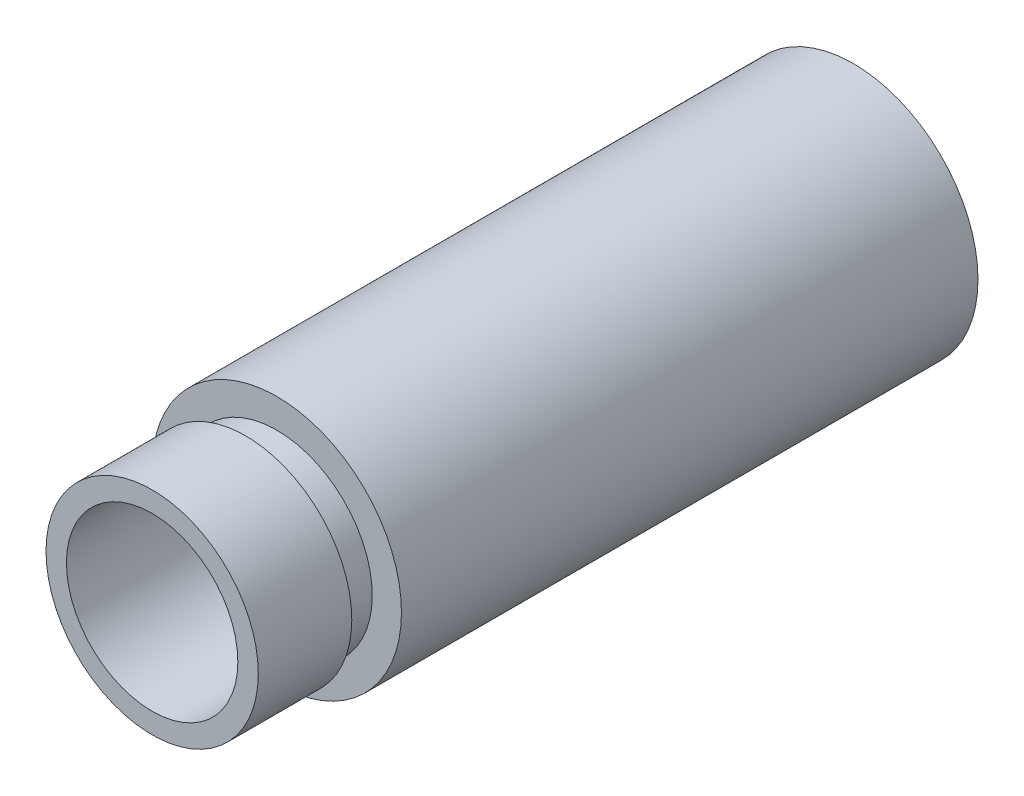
ISO-10303-21;
HEADER;
FILE_DESCRIPTION(('STEP AP214'),'2;1');
FILE_NAME('part.step','',(''),(''),'','','');
FILE_SCHEMA(('AUTOMOTIVE_DESIGN { 1 0 10303 214 1 1 1 1 }'));
ENDSEC;
DATA;
#1=APPLICATION_CONTEXT('core data for automotive mechanical design processes');
#2=APPLICATION_PROTOCOL_DEFINITION('international standard','automotive_design',2000,#1);
#3=PRODUCT_CONTEXT('',#1,'mechanical');
#4=PRODUCT('Part','Part','',(#3));
#5=PRODUCT_RELATED_PRODUCT_CATEGORY('part','',(#4));
#6=PRODUCT_DEFINITION_FORMATION('','',#4);
#7=PRODUCT_DEFINITION_CONTEXT('part definition',#1,'design');
#8=PRODUCT_DEFINITION('design','',#6,#7);
#9=PRODUCT_DEFINITION_SHAPE('','',#8);
#10=(LENGTH_UNIT() NAMED_UNIT(*) SI_UNIT(.MILLI.,.METRE.));
#11=(NAMED_UNIT(*) PLANE_ANGLE_UNIT() SI_UNIT($,.RADIAN.));
#12=(NAMED_UNIT(*) SI_UNIT($,.STERADIAN.) SOLID_ANGLE_UNIT());
#13=UNCERTAINTY_MEASURE_WITH_UNIT(LENGTH_MEASURE(1.E-05),#10,'distance_accuracy_value','');
#14=(GEOMETRIC_REPRESENTATION_CONTEXT(3) GLOBAL_UNCERTAINTY_ASSIGNED_CONTEXT((#13)) GLOBAL_UNIT_ASSIGNED_CONTEXT((#10,
#11,#12)) REPRESENTATION_CONTEXT('',''));
#15=CARTESIAN_POINT('',(0.,0.,0.));
#16=DIRECTION('',(0.,0.,1.));
#17=DIRECTION('',(1.,0.,0.));
#18=AXIS2_PLACEMENT_3D('',#15,#16,#17);
#19=CARTESIAN_POINT('',(0.,0.,0.));
#20=DIRECTION('',(0.,0.,1.));
#21=DIRECTION('',(1.,0.,0.));
#22=AXIS2_PLACEMENT_3D('',#19,#20,#21);
#23=CYLINDRICAL_SURFACE('',#22,8.);
#24=CARTESIAN_POINT('',(0.,0.,0.));
#25=DIRECTION('',(0.,0.,1.));
#26=DIRECTION('',(1.,0.,0.));
#27=AXIS2_PLACEMENT_3D('',#24,#25,#26);
#28=CIRCLE('',#27,8.);
#29=CARTESIAN_POINT('',(8.,0.,0.));
#30=VERTEX_POINT('',#29);
#31=EDGE_CURVE('E45',#30,#30,#28,.T.);
#32=CARTESIAN_POINT('',(0.,0.,37.));
#33=DIRECTION('',(0.,0.,1.));
#34=DIRECTION('',(1.,0.,0.));
#35=AXIS2_PLACEMENT_3D('',#32,#33,#34);
#36=CIRCLE('',#35,8.);
#37=CARTESIAN_POINT('',(8.,0.,37.));
#38=VERTEX_POINT('',#37);
#39=EDGE_CURVE('E29',#38,#38,#36,.F.);
#40=CARTESIAN_POINT('',(8.,0.,0.));
#41=CARTESIAN_POINT('',(8.,0.,0.385416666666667));
#42=CARTESIAN_POINT('',(8.,0.,0.770833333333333));
#43=CARTESIAN_POINT('',(8.,0.,1.54166666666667));
#44=CARTESIAN_POINT('',(8.,0.,1.92708333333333));
#45=CARTESIAN_POINT('',(8.,0.,2.69791666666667));
#46=CARTESIAN_POINT('',(8.,0.,3.08333333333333));
#47=CARTESIAN_POINT('',(8.,0.,3.85416666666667));
#48=CARTESIAN_POINT('',(8.,0.,4.23958333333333));
#49=CARTESIAN_POINT('',(8.,0.,5.01041666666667));
#50=CARTESIAN_POINT('',(8.,0.,5.39583333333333));
#51=CARTESIAN_POINT('',(8.,0.,6.16666666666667));
#52=CARTESIAN_POINT('',(8.,0.,6.55208333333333));
#53=CARTESIAN_POINT('',(8.,0.,7.32291666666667));
#54=CARTESIAN_POINT('',(8.,0.,7.70833333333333));
#55=CARTESIAN_POINT('',(8.,0.,8.47916666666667));
#56=CARTESIAN_POINT('',(8.,0.,8.86458333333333));
#57=CARTESIAN_POINT('',(8.,0.,9.63541666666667));
#58=CARTESIAN_POINT('',(8.,0.,10.0208333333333));
#59=CARTESIAN_POINT('',(8.,0.,10.7916666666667));
#60=CARTESIAN_POINT('',(8.,0.,11.1770833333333));
#61=CARTESIAN_POINT('',(8.,0.,11.9479166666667));
#62=CARTESIAN_POINT('',(8.,0.,12.3333333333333));
#63=CARTESIAN_POINT('',(8.,0.,13.1041666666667));
#64=CARTESIAN_POINT('',(8.,0.,13.4895833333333));
#65=CARTESIAN_POINT('',(8.,0.,14.2604166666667));
#66=CARTESIAN_POINT('',(8.,0.,14.6458333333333));
#67=CARTESIAN_POINT('',(8.,0.,15.4166666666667));
#68=CARTESIAN_POINT('',(8.,0.,15.8020833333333));
#69=CARTESIAN_POINT('',(8.,0.,16.5729166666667));
#70=CARTESIAN_POINT('',(8.,0.,16.9583333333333));
#71=CARTESIAN_POINT('',(8.,0.,17.7291666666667));
#72=CARTESIAN_POINT('',(8.,0.,18.1145833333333));
#73=CARTESIAN_POINT('',(8.,0.,18.8854166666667));
#74=CARTESIAN_POINT('',(8.,0.,19.2708333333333));
#75=CARTESIAN_POINT('',(8.,0.,20.0416666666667));
#76=CARTESIAN_POINT('',(8.,0.,20.4270833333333));
#77=CARTESIAN_POINT('',(8.,0.,21.1979166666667));
#78=CARTESIAN_POINT('',(8.,0.,21.5833333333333));
#79=CARTESIAN_POINT('',(8.,0.,22.3541666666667));
#80=CARTESIAN_POINT('',(8.,0.,22.7395833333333));
#81=CARTESIAN_POINT('',(8.,0.,23.5104166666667));
#82=CARTESIAN_POINT('',(8.,0.,23.8958333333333));
#83=CARTESIAN_POINT('',(8.,0.,24.6666666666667));
#84=CARTESIAN_POINT('',(8.,0.,25.0520833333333));
#85=CARTESIAN_POINT('',(8.,0.,25.8229166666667));
#86=CARTESIAN_POINT('',(8.,0.,26.2083333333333));
#87=CARTESIAN_POINT('',(8.,0.,26.9791666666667));
#88=CARTESIAN_POINT('',(8.,0.,27.3645833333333));
#89=CARTESIAN_POINT('',(8.,0.,28.1354166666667));
#90=CARTESIAN_POINT('',(8.,0.,28.5208333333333));
#91=CARTESIAN_POINT('',(8.,0.,29.2916666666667));
#92=CARTESIAN_POINT('',(8.,0.,29.6770833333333));
#93=CARTESIAN_POINT('',(8.,0.,30.4479166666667));
#94=CARTESIAN_POINT('',(8.,0.,30.8333333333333));
#95=CARTESIAN_POINT('',(8.,0.,31.6041666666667));
#96=CARTESIAN_POINT('',(8.,0.,31.9895833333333));
#97=CARTESIAN_POINT('',(8.,0.,32.7604166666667));
#98=CARTESIAN_POINT('',(8.,0.,33.1458333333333));
#99=CARTESIAN_POINT('',(8.,0.,33.9166666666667));
#100=CARTESIAN_POINT('',(8.,0.,34.3020833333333));
#101=CARTESIAN_POINT('',(8.,0.,35.0729166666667));
#102=CARTESIAN_POINT('',(8.,0.,35.4583333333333));
#103=CARTESIAN_POINT('',(8.,0.,36.2291666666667));
#104=CARTESIAN_POINT('',(8.,0.,36.6145833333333));
#105=CARTESIAN_POINT('',(8.,0.,37.));
#106=B_SPLINE_CURVE_WITH_KNOTS('',3,(#40,#41,#42,#43,#44,#45,#46,#47,#48,#49,#50,#51,#52,#53,
#54,#55,#56,#57,#58,#59,#60,#61,#62,#63,#64,#65,#66,#67,#68,#69,#70,#71,#72,#73,#74,#75,#76,#77,
#78,#79,#80,#81,#82,#83,#84,#85,#86,#87,#88,#89,#90,#91,#92,#93,#94,#95,#96,#97,#98,#99,#100,
#101,#102,#103,#104,#105),.UNSPECIFIED.,.F.,.F.,(4,2,2,2,2,2,2,2,2,2,2,2,2,2,2,2,2,2,2,2,2,2,2,
2,2,2,2,2,2,2,2,2,4),(0.,1.15625,2.3125,3.46875,4.625,5.78125,6.9375,8.09375,9.25,10.40625,
11.5625,12.71875,13.875,15.03125,16.1875,17.34375,18.5,19.65625,20.8125,21.96875,23.125,
24.28125,25.4375,26.59375,27.75,28.90625,30.0625,31.21875,32.375,33.53125,34.6875,35.84375,37.),.UNSPECIFIED.);
#107=EDGE_CURVE('BSEAM25',#30,#38,#106,.T.);
#108=ORIENTED_EDGE('',*,*,#31,.T.);
#109=ORIENTED_EDGE('',*,*,#39,.T.);
#110=ORIENTED_EDGE('',*,*,#107,.T.);
#111=ORIENTED_EDGE('',*,*,#107,.F.);
#112=EDGE_LOOP('',(#108,#110,#109,#111));
#113=FACE_BOUND('',#112,.T.);
#114=ADVANCED_FACE('F25',(#113),#23,.T.);
#115=CARTESIAN_POINT('',(0.,0.,45.));
#116=DIRECTION('',(0.,0.,1.));
#117=DIRECTION('',(1.,0.,0.));
#118=AXIS2_PLACEMENT_3D('',#115,#116,#117);
#119=PLANE('',#118);
#120=CARTESIAN_POINT('',(0.,0.,45.));
#121=DIRECTION('',(0.,0.,1.));
#122=DIRECTION('',(1.,0.,0.));
#123=AXIS2_PLACEMENT_3D('',#120,#121,#122);
#124=CIRCLE('',#123,5.5);
#125=CARTESIAN_POINT('',(5.5,0.,45.));
#126=VERTEX_POINT('',#125);
#127=EDGE_CURVE('E33',#126,#126,#124,.T.);
#128=ORIENTED_EDGE('',*,*,#127,.F.);
#129=EDGE_LOOP('',(#128));
#130=FACE_BOUND('',#129,.T.);
#131=CARTESIAN_POINT('',(0.,0.,45.));
#132=DIRECTION('',(0.,0.,1.));
#133=DIRECTION('',(1.,0.,0.));
#134=AXIS2_PLACEMENT_3D('',#131,#132,#133);
#135=CIRCLE('',#134,6.811875);
#136=CARTESIAN_POINT('',(6.811875,0.,45.));
#137=VERTEX_POINT('',#136);
#138=EDGE_CURVE('E48',#137,#137,#135,.T.);
#139=ORIENTED_EDGE('',*,*,#138,.T.);
#140=EDGE_LOOP('',(#139));
#141=FACE_BOUND('',#140,.T.);
#142=ADVANCED_FACE('F27',(#130,#141),#119,.T.);
#143=CARTESIAN_POINT('',(0.,0.,0.));
#144=DIRECTION('',(0.,0.,1.));
#145=DIRECTION('',(1.,0.,0.));
#146=AXIS2_PLACEMENT_3D('',#143,#144,#145);
#147=PLANE('',#146);
#148=CARTESIAN_POINT('',(0.,0.,0.));
#149=DIRECTION('',(0.,0.,1.));
#150=DIRECTION('',(1.,0.,0.));
#151=AXIS2_PLACEMENT_3D('',#148,#149,#150);
#152=CIRCLE('',#151,4.);
#153=CARTESIAN_POINT('',(4.,0.,0.));
#154=VERTEX_POINT('',#153);
#155=EDGE_CURVE('E37',#154,#154,#152,.T.);
#156=ORIENTED_EDGE('',*,*,#155,.T.);
#157=EDGE_LOOP('',(#156));
#158=FACE_BOUND('',#157,.T.);
#159=ORIENTED_EDGE('',*,*,#31,.F.);
#160=EDGE_LOOP('',(#159));
#161=FACE_BOUND('',#160,.T.);
#162=ADVANCED_FACE('F79',(#158,#161),#147,.F.);
#163=CARTESIAN_POINT('',(0.,0.,3.));
#164=DIRECTION('',(0.,0.,1.));
#165=DIRECTION('',(1.,0.,0.));
#166=AXIS2_PLACEMENT_3D('',#163,#164,#165);
#167=CYLINDRICAL_SURFACE('',#166,5.5);
#168=CARTESIAN_POINT('',(0.,0.,3.));
#169=DIRECTION('',(0.,0.,1.));
#170=DIRECTION('',(1.,0.,0.));
#171=AXIS2_PLACEMENT_3D('',#168,#169,#170);
#172=CIRCLE('',#171,5.5);
#173=CARTESIAN_POINT('',(5.5,0.,3.));
#174=VERTEX_POINT('',#173);
#175=EDGE_CURVE('E10',#174,#174,#172,.T.);
#176=CARTESIAN_POINT('',(5.5,0.,3.));
#177=CARTESIAN_POINT('',(5.5,0.,3.4375));
#178=CARTESIAN_POINT('',(5.5,0.,3.875));
#179=CARTESIAN_POINT('',(5.5,0.,4.74999999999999));
#180=CARTESIAN_POINT('',(5.5,0.,5.18749999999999));
#181=CARTESIAN_POINT('',(5.5,0.,6.0625));
#182=CARTESIAN_POINT('',(5.5,0.,6.5));
#183=CARTESIAN_POINT('',(5.5,0.,7.375));
#184=CARTESIAN_POINT('',(5.5,0.,7.8125));
#185=CARTESIAN_POINT('',(5.5,0.,8.6875));
#186=CARTESIAN_POINT('',(5.5,0.,9.125));
#187=CARTESIAN_POINT('',(5.5,0.,10.));
#188=CARTESIAN_POINT('',(5.5,0.,10.4375));
#189=CARTESIAN_POINT('',(5.5,0.,11.3125));
#190=CARTESIAN_POINT('',(5.5,0.,11.75));
#191=CARTESIAN_POINT('',(5.5,0.,12.625));
#192=CARTESIAN_POINT('',(5.5,0.,13.0625));
#193=CARTESIAN_POINT('',(5.5,0.,13.9375));
#194=CARTESIAN_POINT('',(5.5,0.,14.375));
#195=CARTESIAN_POINT('',(5.5,0.,15.25));
#196=CARTESIAN_POINT('',(5.5,0.,15.6875));
#197=CARTESIAN_POINT('',(5.5,0.,16.5625));
#198=CARTESIAN_POINT('',(5.5,0.,17.));
#199=CARTESIAN_POINT('',(5.5,0.,17.875));
#200=CARTESIAN_POINT('',(5.5,0.,18.3125));
#201=CARTESIAN_POINT('',(5.5,0.,19.1875));
#202=CARTESIAN_POINT('',(5.5,0.,19.625));
#203=CARTESIAN_POINT('',(5.5,0.,20.5));
#204=CARTESIAN_POINT('',(5.5,0.,20.9375));
#205=CARTESIAN_POINT('',(5.5,0.,21.8125));
#206=CARTESIAN_POINT('',(5.5,0.,22.25));
#207=CARTESIAN_POINT('',(5.5,0.,23.125));
#208=CARTESIAN_POINT('',(5.5,0.,23.5625));
#209=CARTESIAN_POINT('',(5.5,0.,24.4375));
#210=CARTESIAN_POINT('',(5.5,0.,24.875));
#211=CARTESIAN_POINT('',(5.5,0.,25.75));
#212=CARTESIAN_POINT('',(5.5,0.,26.1875));
#213=CARTESIAN_POINT('',(5.5,0.,27.0625));
#214=CARTESIAN_POINT('',(5.5,0.,27.5));
#215=CARTESIAN_POINT('',(5.5,0.,28.375));
#216=CARTESIAN_POINT('',(5.5,0.,28.8125));
#217=CARTESIAN_POINT('',(5.5,0.,29.6875));
#218=CARTESIAN_POINT('',(5.5,0.,30.125));
#219=CARTESIAN_POINT('',(5.5,0.,31.));
#220=CARTESIAN_POINT('',(5.5,0.,31.4375));
#221=CARTESIAN_POINT('',(5.5,0.,32.3125));
#222=CARTESIAN_POINT('',(5.5,0.,32.75));
#223=CARTESIAN_POINT('',(5.5,0.,33.625));
#224=CARTESIAN_POINT('',(5.5,0.,34.0625));
#225=CARTESIAN_POINT('',(5.5,0.,34.9375));
#226=CARTESIAN_POINT('',(5.5,0.,35.375));
#227=CARTESIAN_POINT('',(5.5,0.,36.25));
#228=CARTESIAN_POINT('',(5.5,0.,36.6875));
#229=CARTESIAN_POINT('',(5.5,0.,37.5625));
#230=CARTESIAN_POINT('',(5.5,0.,38.));
#231=CARTESIAN_POINT('',(5.5,0.,38.875));
#232=CARTESIAN_POINT('',(5.5,0.,39.3125));
#233=CARTESIAN_POINT('',(5.5,0.,40.1875));
#234=CARTESIAN_POINT('',(5.5,0.,40.625));
#235=CARTESIAN_POINT('',(5.5,0.,41.5));
#236=CARTESIAN_POINT('',(5.5,0.,41.9375));
#237=CARTESIAN_POINT('',(5.5,0.,42.8125));
#238=CARTESIAN_POINT('',(5.5,0.,43.25));
#239=CARTESIAN_POINT('',(5.5,0.,44.125));
#240=CARTESIAN_POINT('',(5.5,0.,44.5625));
#241=CARTESIAN_POINT('',(5.5,0.,45.));
#242=B_SPLINE_CURVE_WITH_KNOTS('',3,(#176,#177,#178,#179,#180,#181,#182,#183,#184,#185,#186,
#187,#188,#189,#190,#191,#192,#193,#194,#195,#196,#197,#198,#199,#200,#201,#202,#203,#204,#205,
#206,#207,#208,#209,#210,#211,#212,#213,#214,#215,#216,#217,#218,#219,#220,#221,#222,#223,#224,
#225,#226,#227,#228,#229,#230,#231,#232,#233,#234,#235,#236,#237,#238,#239,#240,#241),
.UNSPECIFIED.,.F.,.F.,(4,2,2,2,2,2,2,2,2,2,2,2,2,2,2,2,2,2,2,2,2,2,2,2,2,2,2,2,2,2,2,2,4),(0.,
1.3125,2.625,3.9375,5.25,6.5625,7.875,9.1875,10.5,11.8125,13.125,14.4375,15.75,17.0625,18.375,
19.6875,21.,22.3125,23.625,24.9375,26.25,27.5625,28.875,30.1875,31.5,32.8125,34.125,35.4375,
36.75,38.0625,39.375,40.6875,42.),.UNSPECIFIED.);
#243=EDGE_CURVE('BSEAM93',#174,#126,#242,.T.);
#244=ORIENTED_EDGE('',*,*,#175,.F.);
#245=ORIENTED_EDGE('',*,*,#127,.T.);
#246=ORIENTED_EDGE('',*,*,#243,.T.);
#247=ORIENTED_EDGE('',*,*,#243,.F.);
#248=EDGE_LOOP('',(#244,#246,#245,#247));
#249=FACE_BOUND('',#248,.T.);
#250=ADVANCED_FACE('F93',(#249),#167,.F.);
#251=CARTESIAN_POINT('',(0.,0.,3.));
#252=DIRECTION('',(0.,0.,1.));
#253=DIRECTION('',(1.,0.,0.));
#254=AXIS2_PLACEMENT_3D('',#251,#252,#253);
#255=PLANE('',#254);
#256=CARTESIAN_POINT('',(0.,0.,3.));
#257=DIRECTION('',(0.,0.,1.));
#258=DIRECTION('',(1.,0.,0.));
#259=AXIS2_PLACEMENT_3D('',#256,#257,#258);
#260=CIRCLE('',#259,4.);
#261=CARTESIAN_POINT('',(4.,0.,3.));
#262=VERTEX_POINT('',#261);
#263=EDGE_CURVE('E42',#262,#262,#260,.T.);
#264=ORIENTED_EDGE('',*,*,#263,.F.);
#265=EDGE_LOOP('',(#264));
#266=FACE_BOUND('',#265,.T.);
#267=ORIENTED_EDGE('',*,*,#175,.T.);
#268=EDGE_LOOP('',(#267));
#269=FACE_BOUND('',#268,.T.);
#270=ADVANCED_FACE('F89',(#266,#269),#255,.T.);
#271=CARTESIAN_POINT('',(0.,0.,0.));
#272=DIRECTION('',(0.,0.,1.));
#273=DIRECTION('',(1.,0.,0.));
#274=AXIS2_PLACEMENT_3D('',#271,#272,#273);
#275=CYLINDRICAL_SURFACE('',#274,4.);
#276=ORIENTED_EDGE('',*,*,#155,.F.);
#277=EDGE_LOOP('',(#276));
#278=FACE_BOUND('',#277,.T.);
#279=ORIENTED_EDGE('',*,*,#263,.T.);
#280=EDGE_LOOP('',(#279));
#281=FACE_BOUND('',#280,.T.);
#282=ADVANCED_FACE('F86',(#278,#281),#275,.F.);
#283=CARTESIAN_POINT('',(0.,0.,39.));
#284=DIRECTION('',(0.,0.,1.));
#285=DIRECTION('',(1.,0.,0.));
#286=AXIS2_PLACEMENT_3D('',#283,#284,#285);
#287=CYLINDRICAL_SURFACE('',#286,6.811875);
#288=CARTESIAN_POINT('',(0.,0.,39.));
#289=DIRECTION('',(0.,0.,1.));
#290=DIRECTION('',(1.,0.,0.));
#291=AXIS2_PLACEMENT_3D('',#288,#289,#290);
#292=CIRCLE('',#291,6.811875);
#293=CARTESIAN_POINT('',(6.811875,0.,39.));
#294=VERTEX_POINT('',#293);
#295=EDGE_CURVE('E51',#294,#294,#292,.F.);
#296=ORIENTED_EDGE('',*,*,#295,.F.);
#297=EDGE_LOOP('',(#296));
#298=FACE_BOUND('',#297,.T.);
#299=ORIENTED_EDGE('',*,*,#138,.F.);
#300=EDGE_LOOP('',(#299));
#301=FACE_BOUND('',#300,.T.);
#302=ADVANCED_FACE('F84',(#298,#301),#287,.T.);
#303=CARTESIAN_POINT('',(0.,0.,37.));
#304=DIRECTION('',(0.,0.,1.));
#305=DIRECTION('',(1.,0.,0.));
#306=AXIS2_PLACEMENT_3D('',#303,#304,#305);
#307=PLANE('',#306);
#308=ORIENTED_EDGE('',*,*,#39,.F.);
#309=EDGE_LOOP('',(#308));
#310=FACE_BOUND('',#309,.T.);
#311=CARTESIAN_POINT('',(0.,0.,37.));
#312=DIRECTION('',(0.,0.,1.));
#313=DIRECTION('',(1.,0.,0.));
#314=AXIS2_PLACEMENT_3D('',#311,#312,#313);
#315=CIRCLE('',#314,6.125);
#316=CARTESIAN_POINT('',(6.125,0.,37.));
#317=VERTEX_POINT('',#316);
#318=EDGE_CURVE('E54',#317,#317,#315,.T.);
#319=ORIENTED_EDGE('',*,*,#318,.F.);
#320=EDGE_LOOP('',(#319));
#321=FACE_BOUND('',#320,.T.);
#322=ADVANCED_FACE('F70',(#310,#321),#307,.T.);
#323=CARTESIAN_POINT('',(0.,0.,39.));
#324=DIRECTION('',(0.,0.,1.));
#325=DIRECTION('',(1.,0.,0.));
#326=AXIS2_PLACEMENT_3D('',#323,#324,#325);
#327=PLANE('',#326);
#328=ORIENTED_EDGE('',*,*,#295,.T.);
#329=EDGE_LOOP('',(#328));
#330=FACE_BOUND('',#329,.T.);
#331=CARTESIAN_POINT('',(0.,0.,39.));
#332=DIRECTION('',(0.,0.,1.));
#333=DIRECTION('',(1.,0.,0.));
#334=AXIS2_PLACEMENT_3D('',#331,#332,#333);
#335=CIRCLE('',#334,6.125);
#336=CARTESIAN_POINT('',(6.125,0.,39.));
#337=VERTEX_POINT('',#336);
#338=EDGE_CURVE('E57',#337,#337,#335,.T.);
#339=ORIENTED_EDGE('',*,*,#338,.T.);
#340=EDGE_LOOP('',(#339));
#341=FACE_BOUND('',#340,.T.);
#342=ADVANCED_FACE('F61',(#330,#341),#327,.F.);
#343=CARTESIAN_POINT('',(0.,0.,37.));
#344=DIRECTION('',(0.,0.,1.));
#345=DIRECTION('',(1.,0.,0.));
#346=AXIS2_PLACEMENT_3D('',#343,#344,#345);
#347=CYLINDRICAL_SURFACE('',#346,6.125);
#348=ORIENTED_EDGE('',*,*,#318,.T.);
#349=EDGE_LOOP('',(#348));
#350=FACE_BOUND('',#349,.T.);
#351=ORIENTED_EDGE('',*,*,#338,.F.);
#352=EDGE_LOOP('',(#351));
#353=FACE_BOUND('',#352,.T.);
#354=ADVANCED_FACE('F63',(#350,#353),#347,.T.);
#355=CLOSED_SHELL('',(#114,#142,#162,#250,#270,#282,#302,#322,#342,#354));
#356=MANIFOLD_SOLID_BREP('B2',#355);
#357=ADVANCED_BREP_SHAPE_REPRESENTATION('',(#18,#356),#14);
#358=SHAPE_DEFINITION_REPRESENTATION(#9,#357);
ENDSEC;
END-ISO-10303-21;
